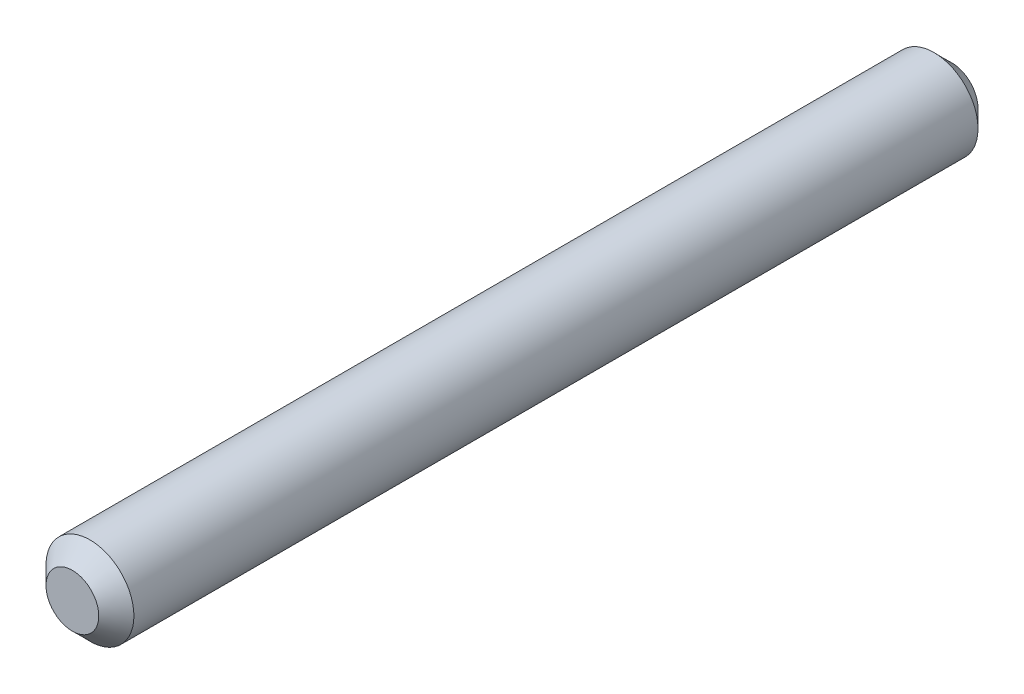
from build123d import *

# Parameters (mm, degrees)
ESQUISSE1_R          = 1.25
BASE_EXTRUSION_DEPTH = 25
CHANFREIN1_SIZE      = 0.5


with BuildPart() as part:
    # Esquisse1 → Base-Extrusion (new body)
    with BuildSketch(Plane.XY):
        Circle(ESQUISSE1_R)
    extrude(amount=BASE_EXTRUSION_DEPTH)

    # Chanfrein1
    chanfrein1_edges = [part.edges().sort_by_distance(p)[0] for p in [
        (-1.25, 0, 0),
        (-1.25, 0, 25),
    ]]
    chamfer(chanfrein1_edges, length=CHANFREIN1_SIZE)


solid = part.part
